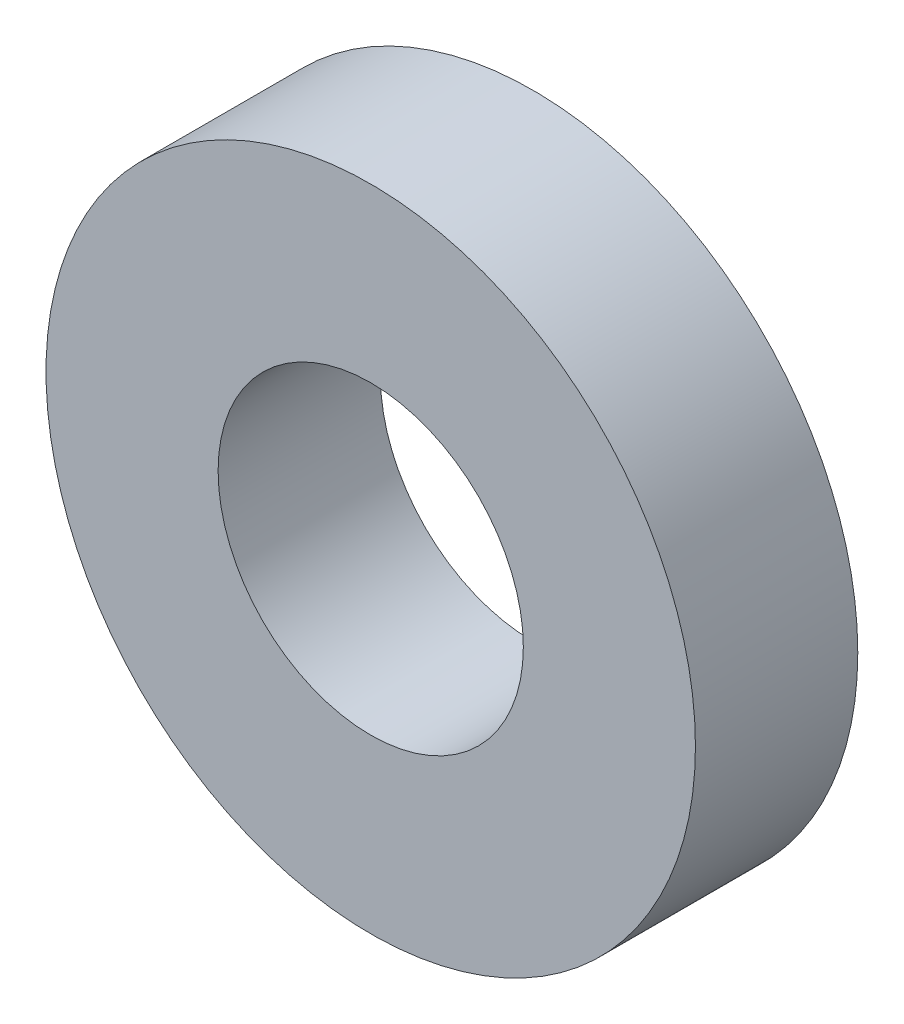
ISO-10303-21;
HEADER;
FILE_DESCRIPTION(('STEP AP214'),'2;1');
FILE_NAME('part.step','',(''),(''),'','','');
FILE_SCHEMA(('AUTOMOTIVE_DESIGN { 1 0 10303 214 1 1 1 1 }'));
ENDSEC;
DATA;
#1=APPLICATION_CONTEXT('core data for automotive mechanical design processes');
#2=APPLICATION_PROTOCOL_DEFINITION('international standard','automotive_design',2000,#1);
#3=PRODUCT_CONTEXT('',#1,'mechanical');
#4=PRODUCT('Part','Part','',(#3));
#5=PRODUCT_RELATED_PRODUCT_CATEGORY('part','',(#4));
#6=PRODUCT_DEFINITION_FORMATION('','',#4);
#7=PRODUCT_DEFINITION_CONTEXT('part definition',#1,'design');
#8=PRODUCT_DEFINITION('design','',#6,#7);
#9=PRODUCT_DEFINITION_SHAPE('','',#8);
#10=(LENGTH_UNIT() NAMED_UNIT(*) SI_UNIT(.MILLI.,.METRE.));
#11=(NAMED_UNIT(*) PLANE_ANGLE_UNIT() SI_UNIT($,.RADIAN.));
#12=(NAMED_UNIT(*) SI_UNIT($,.STERADIAN.) SOLID_ANGLE_UNIT());
#13=UNCERTAINTY_MEASURE_WITH_UNIT(LENGTH_MEASURE(1.E-05),#10,'distance_accuracy_value','');
#14=(GEOMETRIC_REPRESENTATION_CONTEXT(3) GLOBAL_UNCERTAINTY_ASSIGNED_CONTEXT((#13)) GLOBAL_UNIT_ASSIGNED_CONTEXT((#10,
#11,#12)) REPRESENTATION_CONTEXT('',''));
#15=CARTESIAN_POINT('',(0.,0.,0.));
#16=DIRECTION('',(0.,0.,1.));
#17=DIRECTION('',(1.,0.,0.));
#18=AXIS2_PLACEMENT_3D('',#15,#16,#17);
#19=CARTESIAN_POINT('',(0.,0.,2.54));
#20=DIRECTION('',(0.,0.,1.));
#21=DIRECTION('',(1.,0.,0.));
#22=AXIS2_PLACEMENT_3D('',#19,#20,#21);
#23=PLANE('',#22);
#24=CARTESIAN_POINT('',(0.,0.,2.54));
#25=DIRECTION('',(0.,0.,1.));
#26=DIRECTION('',(1.,0.,0.));
#27=AXIS2_PLACEMENT_3D('',#24,#25,#26);
#28=CIRCLE('',#27,5.08);
#29=CARTESIAN_POINT('',(5.08,0.,2.54));
#30=VERTEX_POINT('',#29);
#31=EDGE_CURVE('E10',#30,#30,#28,.T.);
#32=ORIENTED_EDGE('',*,*,#31,.T.);
#33=EDGE_LOOP('',(#32));
#34=FACE_BOUND('',#33,.T.);
#35=CARTESIAN_POINT('',(0.,0.,2.54));
#36=DIRECTION('',(0.,0.,1.));
#37=DIRECTION('',(1.,0.,0.));
#38=AXIS2_PLACEMENT_3D('',#35,#36,#37);
#39=CIRCLE('',#38,2.3876);
#40=CARTESIAN_POINT('',(2.3876,0.,2.54));
#41=VERTEX_POINT('',#40);
#42=EDGE_CURVE('E39',#41,#41,#39,.T.);
#43=ORIENTED_EDGE('',*,*,#42,.F.);
#44=EDGE_LOOP('',(#43));
#45=FACE_BOUND('',#44,.T.);
#46=ADVANCED_FACE('F28',(#34,#45),#23,.T.);
#47=CARTESIAN_POINT('',(0.,0.,0.));
#48=DIRECTION('',(0.,0.,1.));
#49=DIRECTION('',(1.,0.,0.));
#50=AXIS2_PLACEMENT_3D('',#47,#48,#49);
#51=PLANE('',#50);
#52=CARTESIAN_POINT('',(0.,0.,0.));
#53=DIRECTION('',(0.,0.,1.));
#54=DIRECTION('',(1.,0.,0.));
#55=AXIS2_PLACEMENT_3D('',#52,#53,#54);
#56=CIRCLE('',#55,5.08);
#57=CARTESIAN_POINT('',(5.08,0.,0.));
#58=VERTEX_POINT('',#57);
#59=EDGE_CURVE('E35',#58,#58,#56,.T.);
#60=ORIENTED_EDGE('',*,*,#59,.F.);
#61=EDGE_LOOP('',(#60));
#62=FACE_BOUND('',#61,.T.);
#63=CARTESIAN_POINT('',(0.,0.,0.));
#64=DIRECTION('',(0.,0.,1.));
#65=DIRECTION('',(1.,0.,0.));
#66=AXIS2_PLACEMENT_3D('',#63,#64,#65);
#67=CIRCLE('',#66,2.3876);
#68=CARTESIAN_POINT('',(2.3876,0.,0.));
#69=VERTEX_POINT('',#68);
#70=EDGE_CURVE('E43',#69,#69,#67,.T.);
#71=ORIENTED_EDGE('',*,*,#70,.T.);
#72=EDGE_LOOP('',(#71));
#73=FACE_BOUND('',#72,.T.);
#74=ADVANCED_FACE('F49',(#62,#73),#51,.F.);
#75=CARTESIAN_POINT('',(0.,0.,2.54));
#76=DIRECTION('',(0.,0.,-1.));
#77=DIRECTION('',(-1.,0.,0.));
#78=AXIS2_PLACEMENT_3D('',#75,#76,#77);
#79=CYLINDRICAL_SURFACE('',#78,5.08);
#80=ORIENTED_EDGE('',*,*,#31,.F.);
#81=EDGE_LOOP('',(#80));
#82=FACE_BOUND('',#81,.T.);
#83=ORIENTED_EDGE('',*,*,#59,.T.);
#84=EDGE_LOOP('',(#83));
#85=FACE_BOUND('',#84,.T.);
#86=ADVANCED_FACE('F30',(#82,#85),#79,.T.);
#87=CARTESIAN_POINT('',(0.,0.,2.54));
#88=DIRECTION('',(0.,0.,-1.));
#89=DIRECTION('',(-1.,0.,0.));
#90=AXIS2_PLACEMENT_3D('',#87,#88,#89);
#91=CYLINDRICAL_SURFACE('',#90,2.3876);
#92=ORIENTED_EDGE('',*,*,#42,.T.);
#93=EDGE_LOOP('',(#92));
#94=FACE_BOUND('',#93,.T.);
#95=ORIENTED_EDGE('',*,*,#70,.F.);
#96=EDGE_LOOP('',(#95));
#97=FACE_BOUND('',#96,.T.);
#98=ADVANCED_FACE('F51',(#94,#97),#91,.F.);
#99=CLOSED_SHELL('',(#46,#74,#86,#98));
#100=MANIFOLD_SOLID_BREP('B2',#99);
#101=ADVANCED_BREP_SHAPE_REPRESENTATION('',(#18,#100),#14);
#102=SHAPE_DEFINITION_REPRESENTATION(#9,#101);
ENDSEC;
END-ISO-10303-21;
